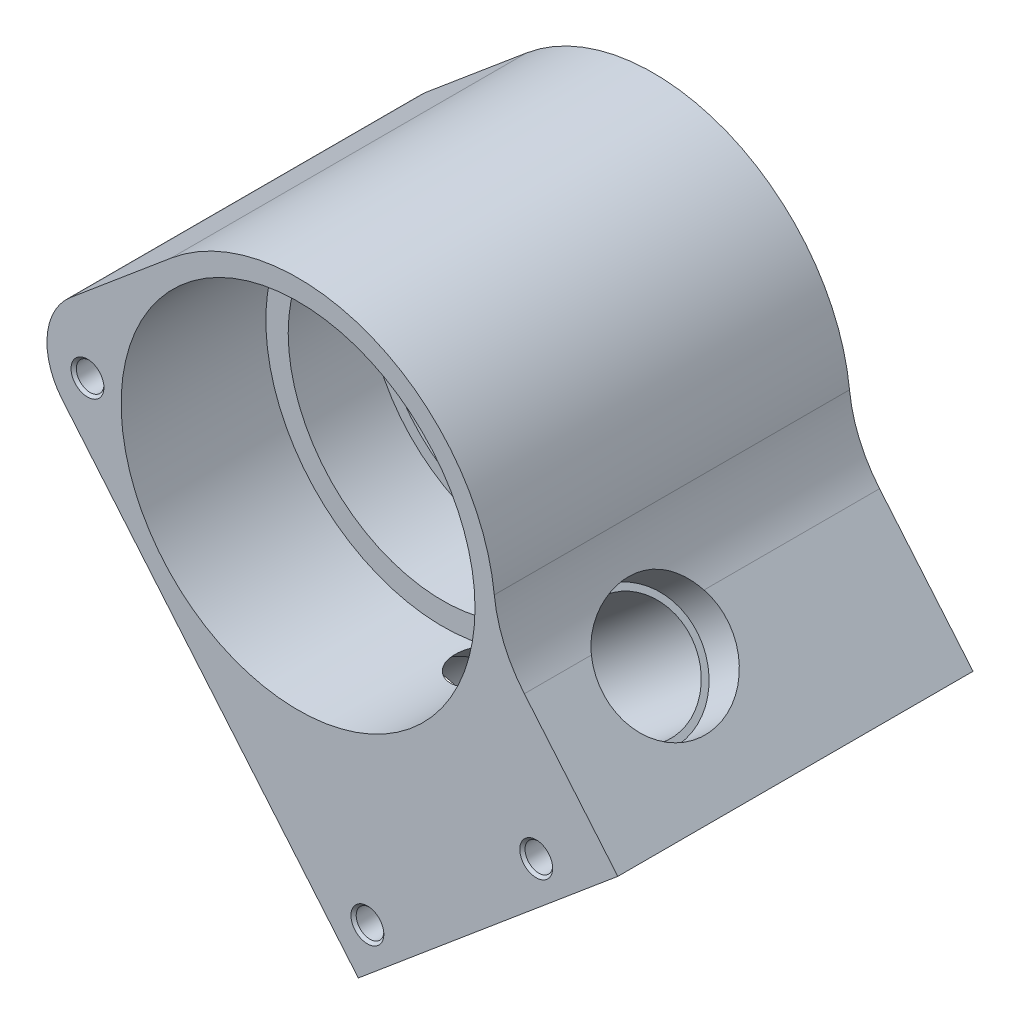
from build123d import *

# Parameters (mm, degrees)
ESQUISSE1_R                     = 21.75
EXTRUSION1_DEPTH                = 54
ESQUISSE3_R                     = 8.5
ENL_V_MAT_EXTRU_1_DEPTH         = 75
ESQUISSE16_R                    = 23.5
ENL_V_MAT_EXTRU_2_DEPTH         = 12
ESQUISSE36_R                    = 26.9
ENL_V_MAT_EXTRU_13_DEPTH        = 22
ESQUISSE37_R                    = 23.5005
ENL_V_MAT_EXTRU_14_DEPTH        = 12
TROU_TARAUD_M5X0_81_D           = 4.2
TROU_TARAUD_M5X0_81_DEPTH       = 11.4
TROU_TARAUD_M5X0_81_CSINK_D     = 5
TROU_TARAUD_M5X0_81_CSINK_ANGLE = 90
TROU_TARAUD_M5X0_81_TIP         = 1.212435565
TROU_TARAUD_M4X0_75_D           = 3.3
TROU_TARAUD_M4X0_75_DEPTH       = 10.1
TROU_TARAUD_M4X0_75_CSINK_D     = 4
TROU_TARAUD_M4X0_75_CSINK_ANGLE = 90
TROU_TARAUD_M4X0_75_TIP         = 0.952627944
TROU_TARAUD_M6X1_02_D           = 5
TROU_TARAUD_M6X1_02_DEPTH       = 14
TROU_TARAUD_M6X1_02_CSINK_D     = 6
TROU_TARAUD_M6X1_02_CSINK_ANGLE = 90
TROU_TARAUD_M6X1_02_TIP         = 1.443375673
ESQUISSE33_R                    = 11
ENL_V_MAT_EXTRU_9_DEPTH         = 12.5
CONG_1_R                        = 10
ENL_V_MAT_EXTRU_10_REACH        = 113.918
ENL_V_MAT_EXTRU_10_END_RADIUS   = 11
ESQUISSE26_R                    = 2.1
ESQUISSE35_R                    = 9.5
ENL_V_MAT_EXTRU_11_DEPTH        = 6


with BuildPart() as part:
    # Esquisse1 → Extrusion1 (new body)
    with BuildSketch(Plane.XY):
        with BuildLine():
            Line((34.396125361, -7.543643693), (48.609336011, -24.482288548))
            Line((48.609336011, -24.482288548), (9.158047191, -57.585850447))
            Line((9.158047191, -57.585850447), (-42.264961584, 3.697705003))
            Line((-42.264961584, 3.697705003), (-19.283628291, 22.981333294))
            ThreePointArc((-19.283628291, 22.981333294), (11.214226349, 27.825188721), (29.830208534, 3.187265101))
            ThreePointArc((29.830208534, 3.187265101), (31.31365747, -2.518374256), (34.396125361, -7.543643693))
        make_face()
        Circle(ESQUISSE1_R, mode=Mode.SUBTRACT)
    extrude(amount=EXTRUSION1_DEPTH)

    # Esquisse3 → Enl_v. mat.-Extru.1 (cut, symmetric)
    with BuildSketch(Plane(origin=(16.469955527, 13.819933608, 0), x_dir=(0, 0, -1), z_dir=(0.7660444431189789, 0.6427876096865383, 0))):
        with Locations(Location((-35.25, -32, 0), (0, 0, 90))):
            Circle(ESQUISSE3_R)
    extrude(amount=ENL_V_MAT_EXTRU_1_DEPTH, both=True, mode=Mode.SUBTRACT)

    # Esquisse16 → Enl_v. mat.-Extru.2 (cut)
    with BuildSketch(Plane(origin=(0, 0, 0), x_dir=(-1, 0, 0), z_dir=(0, 0, -1))):
        Circle(ESQUISSE16_R)
    extrude(amount=-ENL_V_MAT_EXTRU_2_DEPTH, mode=Mode.SUBTRACT)

    # Esquisse36 → Enl_v. mat.-Extru.13 (cut)
    with BuildSketch(Plane.XY.offset(54)):
        Circle(ESQUISSE36_R)
    extrude(amount=-ENL_V_MAT_EXTRU_13_DEPTH, mode=Mode.SUBTRACT)

    # Esquisse37 → Enl_v. mat.-Extru.14 (cut)
    with BuildSketch(Plane.XY.offset(32)):
        Circle(ESQUISSE37_R)
    extrude(amount=-ENL_V_MAT_EXTRU_14_DEPTH, mode=Mode.SUBTRACT)

    # Trou taraud_ M5x0.81
    with Locations(Plane.XY.offset(54)):
        with Locations((36.202864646, -28.365517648), (-32.01216396, 0.813239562), (10.540375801, -49.898902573)):
            CounterSinkHole(TROU_TARAUD_M5X0_81_D / 2, TROU_TARAUD_M5X0_81_CSINK_D / 2, depth=TROU_TARAUD_M5X0_81_DEPTH, counter_sink_angle=TROU_TARAUD_M5X0_81_CSINK_ANGLE)
            with Locations((0, 0, -(TROU_TARAUD_M5X0_81_DEPTH + TROU_TARAUD_M5X0_81_TIP / 2))):  # 120° drill point
                Cone(0, TROU_TARAUD_M5X0_81_D / 2, TROU_TARAUD_M5X0_81_TIP, mode=Mode.SUBTRACT)

    # Trou taraud_ M4x0.75
    with Locations(Plane(origin=(-22.981333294, -19.283628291, 0), x_dir=(0, 0, 1), z_dir=(-0.7660444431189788, -0.6427876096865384, 0))):
        with Locations((20.5, -42), (20.5, -22), (50, -22), (50, -40)):
            CounterSinkHole(TROU_TARAUD_M4X0_75_D / 2, TROU_TARAUD_M4X0_75_CSINK_D / 2, depth=TROU_TARAUD_M4X0_75_DEPTH, counter_sink_angle=TROU_TARAUD_M4X0_75_CSINK_ANGLE)
            with Locations((0, 0, -(TROU_TARAUD_M4X0_75_DEPTH + TROU_TARAUD_M4X0_75_TIP / 2))):  # 120° drill point
                Cone(0, TROU_TARAUD_M4X0_75_D / 2, TROU_TARAUD_M4X0_75_TIP, mode=Mode.SUBTRACT)

    # Trou taraud_ M6x1.02
    with Locations(Plane(origin=(32.139380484, -38.302222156, 0), x_dir=(0.7660444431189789, 0.6427876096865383, 0), z_dir=(0.6427876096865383, -0.7660444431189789, 0))):
        with Locations((15.5, 6), (-16.5, 6), (15.5, 48), (-16.5, 48)):
            CounterSinkHole(TROU_TARAUD_M6X1_02_D / 2, TROU_TARAUD_M6X1_02_CSINK_D / 2, depth=TROU_TARAUD_M6X1_02_DEPTH, counter_sink_angle=TROU_TARAUD_M6X1_02_CSINK_ANGLE)
            with Locations((0, 0, -(TROU_TARAUD_M6X1_02_DEPTH + TROU_TARAUD_M6X1_02_TIP / 2))):  # 120° drill point
                Cone(0, TROU_TARAUD_M6X1_02_D / 2, TROU_TARAUD_M6X1_02_TIP, mode=Mode.SUBTRACT)

    # Esquisse33 → Enl_v. mat.-Extru.9 (cut)
    with BuildSketch(Plane(origin=(-22.981333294, -19.283628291, 0), x_dir=(0, 0, 1), z_dir=(-0.7660444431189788, -0.6427876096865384, 0))):
        with Locations(Location((35.25, -32, 0), (0, 0, 270))):
            Circle(ESQUISSE33_R)
    extrude(amount=-ENL_V_MAT_EXTRU_9_DEPTH, mode=Mode.SUBTRACT)

    # Cong_1
    cong_1_edges = [part.edges().sort_by_distance(p)[0] for p in [
        (-42.264961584, 3.697705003, 27),
    ]]
    fillet(cong_1_edges, radius=CONG_1_R)

    # Enl_v. mat.-Extru.10: up to this cylinder (the profile starts outside it)
    enl_v_mat_extru_10_end = Plane(origin=(-0.03739206, -41.804408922, 35.25), z_dir=(-0.7660444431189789, -0.6427876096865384, 0)) * Cylinder(ENL_V_MAT_EXTRU_10_END_RADIUS, 250.836, mode=Mode.PRIVATE)
    # Esquisse26 → Enl_v. mat.-Extru.10 (cut, up to the surface)
    with BuildSketch(Plane(origin=(32.139380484, -38.302222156, 0), x_dir=(0.7660444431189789, 0.6427876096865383, 0), z_dir=(0.6427876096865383, -0.7660444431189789, 0)), mode=Mode.PRIVATE) as enl_v_mat_extru_10_sk1:
        with Locations((-26.9, 29)):
            Circle(ESQUISSE26_R)
    enl_v_mat_extru_10_tool1 = extrude(enl_v_mat_extru_10_sk1.sketch, amount=-ENL_V_MAT_EXTRU_10_REACH, mode=Mode.PRIVATE) - enl_v_mat_extru_10_end
    add(enl_v_mat_extru_10_tool1.solids().sort_by_distance((11.532785, -55.593209, 29))[0], mode=Mode.SUBTRACT)

    # Esquisse35 → Enl_v. mat.-Extru.11 (cut, symmetric)
    with BuildSketch(Plane(origin=(16.469955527, 13.819933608, 0), x_dir=(0, 0, -1), z_dir=(0.7660444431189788, 0.6427876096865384, 0))):
        with Locations(Location((-35.25, -32, 0), (0, 0, 90))):
            Circle(ESQUISSE35_R)
    extrude(amount=ENL_V_MAT_EXTRU_11_DEPTH, both=True, mode=Mode.SUBTRACT)


solid = part.part
